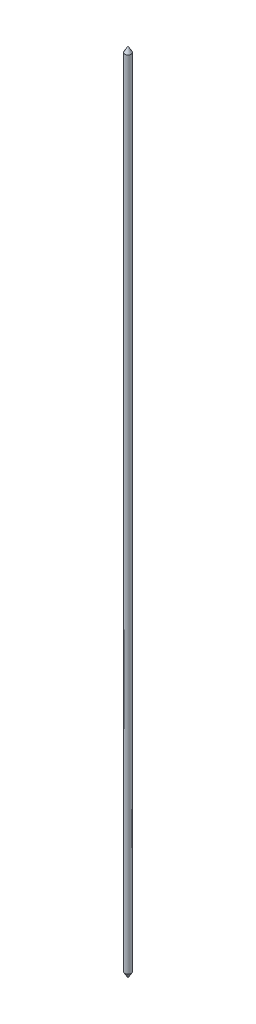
ISO-10303-21;
HEADER;
FILE_DESCRIPTION(('STEP AP214'),'2;1');
FILE_NAME('part.step','',(''),(''),'','','');
FILE_SCHEMA(('AUTOMOTIVE_DESIGN { 1 0 10303 214 1 1 1 1 }'));
ENDSEC;
DATA;
#1=APPLICATION_CONTEXT('core data for automotive mechanical design processes');
#2=APPLICATION_PROTOCOL_DEFINITION('international standard','automotive_design',2000,#1);
#3=PRODUCT_CONTEXT('',#1,'mechanical');
#4=PRODUCT('Part','Part','',(#3));
#5=PRODUCT_RELATED_PRODUCT_CATEGORY('part','',(#4));
#6=PRODUCT_DEFINITION_FORMATION('','',#4);
#7=PRODUCT_DEFINITION_CONTEXT('part definition',#1,'design');
#8=PRODUCT_DEFINITION('design','',#6,#7);
#9=PRODUCT_DEFINITION_SHAPE('','',#8);
#10=(LENGTH_UNIT() NAMED_UNIT(*) SI_UNIT(.MILLI.,.METRE.));
#11=(NAMED_UNIT(*) PLANE_ANGLE_UNIT() SI_UNIT($,.RADIAN.));
#12=(NAMED_UNIT(*) SI_UNIT($,.STERADIAN.) SOLID_ANGLE_UNIT());
#13=UNCERTAINTY_MEASURE_WITH_UNIT(LENGTH_MEASURE(1.E-05),#10,'distance_accuracy_value','');
#14=(GEOMETRIC_REPRESENTATION_CONTEXT(3) GLOBAL_UNCERTAINTY_ASSIGNED_CONTEXT((#13)) GLOBAL_UNIT_ASSIGNED_CONTEXT((#10,
#11,#12)) REPRESENTATION_CONTEXT('',''));
#15=CARTESIAN_POINT('',(0.,0.,0.));
#16=DIRECTION('',(0.,0.,1.));
#17=DIRECTION('',(1.,0.,0.));
#18=AXIS2_PLACEMENT_3D('',#15,#16,#17);
#19=CARTESIAN_POINT('',(0.,250.,0.));
#20=DIRECTION('',(0.,-1.,0.));
#21=DIRECTION('',(0.,0.,-1.));
#22=AXIS2_PLACEMENT_3D('',#19,#20,#21);
#23=CYLINDRICAL_SURFACE('',#22,1.);
#24=CARTESIAN_POINT('',(0.,250.,0.));
#25=DIRECTION('',(0.,1.,0.));
#26=DIRECTION('',(0.,0.,1.));
#27=AXIS2_PLACEMENT_3D('',#24,#25,#26);
#28=CIRCLE('',#27,1.);
#29=CARTESIAN_POINT('',(0.,250.,1.));
#30=VERTEX_POINT('',#29);
#31=EDGE_CURVE('E11',#30,#30,#28,.T.);
#32=ORIENTED_EDGE('',*,*,#31,.F.);
#33=EDGE_LOOP('',(#32));
#34=FACE_BOUND('',#33,.T.);
#35=CARTESIAN_POINT('',(0.,0.,0.));
#36=DIRECTION('',(0.,-1.,0.));
#37=DIRECTION('',(0.,0.,-1.));
#38=AXIS2_PLACEMENT_3D('',#35,#36,#37);
#39=CIRCLE('',#38,1.);
#40=CARTESIAN_POINT('',(0.,0.,-1.));
#41=VERTEX_POINT('',#40);
#42=EDGE_CURVE('E40',#41,#41,#39,.T.);
#43=ORIENTED_EDGE('',*,*,#42,.F.);
#44=EDGE_LOOP('',(#43));
#45=FACE_BOUND('',#44,.T.);
#46=ADVANCED_FACE('F33',(#34,#45),#23,.T.);
#47=CARTESIAN_POINT('',(0.,250.,0.));
#48=DIRECTION('',(0.,-1.,0.));
#49=DIRECTION('',(0.,0.,1.));
#50=AXIS2_PLACEMENT_3D('',#47,#48,#49);
#51=CONICAL_SURFACE('',#50,1.,0.5235987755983);
#52=CARTESIAN_POINT('',(0.,251.732050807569,0.));
#53=VERTEX_POINT('',#52);
#54=VERTEX_LOOP('',#53);
#55=FACE_BOUND('',#54,.T.);
#56=ORIENTED_EDGE('',*,*,#31,.T.);
#57=EDGE_LOOP('',(#56));
#58=FACE_BOUND('',#57,.T.);
#59=ADVANCED_FACE('F49',(#55,#58),#51,.T.);
#60=CARTESIAN_POINT('',(0.,0.,0.));
#61=DIRECTION('',(0.,1.,0.));
#62=DIRECTION('',(0.,0.,-1.));
#63=AXIS2_PLACEMENT_3D('',#60,#61,#62);
#64=CONICAL_SURFACE('',#63,1.,0.5235987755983);
#65=CARTESIAN_POINT('',(0.,-1.73205080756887,0.));
#66=VERTEX_POINT('',#65);
#67=VERTEX_LOOP('',#66);
#68=FACE_BOUND('',#67,.T.);
#69=ORIENTED_EDGE('',*,*,#42,.T.);
#70=EDGE_LOOP('',(#69));
#71=FACE_BOUND('',#70,.T.);
#72=ADVANCED_FACE('F46',(#68,#71),#64,.T.);
#73=CLOSED_SHELL('',(#46,#59,#72));
#74=MANIFOLD_SOLID_BREP('B2',#73);
#75=ADVANCED_BREP_SHAPE_REPRESENTATION('',(#18,#74),#14);
#76=SHAPE_DEFINITION_REPRESENTATION(#9,#75);
ENDSEC;
END-ISO-10303-21;
